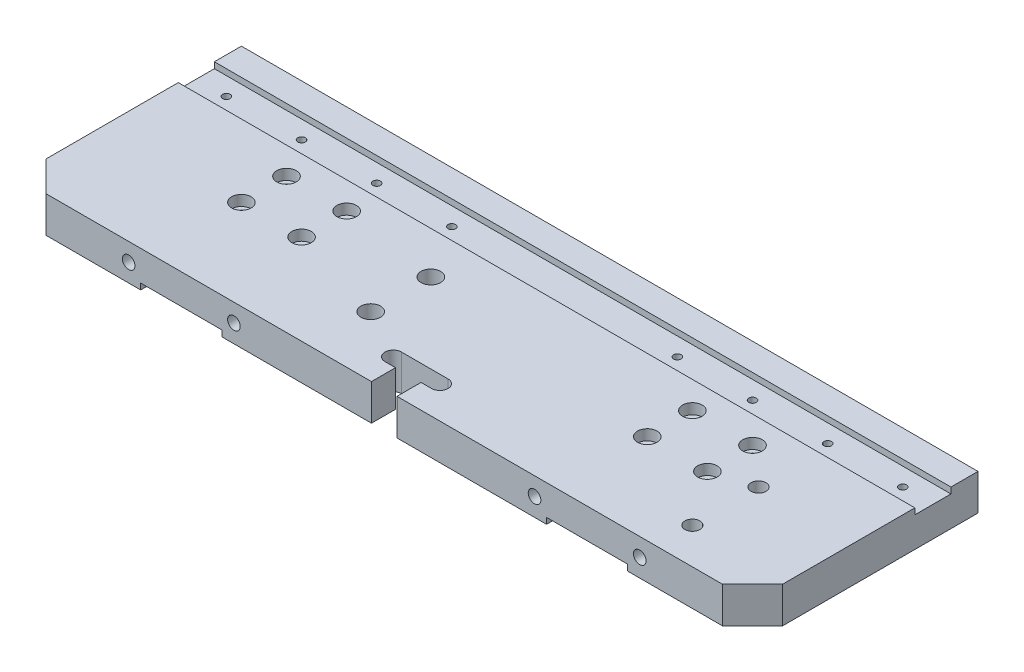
from build123d import *

# Parameters (mm, degrees)
EXTRUDE_1_DEPTH          = 75
SKETCH_2_R               = 2.1
CUT_EXTRUDE_1_DEPTH      = 15
CUT_EXTRUDE_2_DEPTH      = 257.503411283
CUT_EXTRUDE_2_DEPTH_BACK = 257.503411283
SKETCH_3_W               = 12
SKETCH_3_H               = 2
SKETCH_5_R               = 2.5
CUT_EXTRUDE_3_DEPTH      = 15
SKETCH_6_OUTSIDE_W       = 298.3
SKETCH_6_OUTSIDE_H       = 128.3
SKETCH_6_OUTSIDE_R       = 1.25
SKETCH_6_OUTSIDE_R_2     = 2.5
SKETCH_6_OUTSIDE_R_3     = 1.75
SKETCH_6_OUTSIDE_R_4     = 3.25
CUT_EXTRUDE_4_DEPTH      = 15
SKETCH_7_R               = 3.25
CUT_EXTRUDE_5_DEPTH      = 3.5
SKETCH_9_R               = 5.5
CUT_EXTRUDE_6_DEPTH      = 3.5


with BuildPart() as part:
    # Sketch 1 → Extrude 1 (new body)
    with BuildSketch(Plane.XY):
        Polygon((0, 12), (245, 12), (245, 0), (203.5, 0), (203.5, 2), (176.5, 2), (176.5, 0), (68.5, 0), (68.5, 2), (41.5, 2), (41.5, 0), (0, 0), align=None)
    extrude(amount=EXTRUDE_1_DEPTH)

    # Sketch 2 → Cut-Extrude 1 (cut)
    with BuildSketch(Plane.XY.offset(75)):
        with Locations((37.5, 6)):
            Circle(SKETCH_2_R)
        with Locations((72.5, 6)):
            Circle(SKETCH_2_R)
        with Locations((172.5, 6)):
            Circle(SKETCH_2_R)
        with Locations((207.5, 6)):
            Circle(SKETCH_2_R)
    extrude(amount=-CUT_EXTRUDE_1_DEPTH, mode=Mode.SUBTRACT)

    # Sketch 3 → Cut-Extrude 2 (cut, two sides: drawn at the far end of the back side and taken through both)
    with BuildSketch(Plane(origin=(245, 0, 0), x_dir=(0, 0, -1), z_dir=(1, 0, 0)).offset(-CUT_EXTRUDE_2_DEPTH_BACK)):
        with Locations((-15, 11)):
            Rectangle(SKETCH_3_W, SKETCH_3_H)
    extrude(amount=CUT_EXTRUDE_2_DEPTH + CUT_EXTRUDE_2_DEPTH_BACK, mode=Mode.SUBTRACT)

    # Sketch 5 → Cut-Extrude 3 (cut)
    with BuildSketch(Plane.ZY):
        with Locations((38, 6)):
            Circle(SKETCH_5_R)
        with Locations((52, 6)):
            Circle(SKETCH_5_R)
    extrude(amount=-CUT_EXTRUDE_3_DEPTH, mode=Mode.SUBTRACT)

    # Sketch 6 outside → Cut-Extrude 4 (cut)
    # profile 1 of 21: a face of its own
    with BuildSketch(Plane(origin=(0, 12, 0), x_dir=(1, 0, 0), z_dir=(0, 1, 0))):
        with Locations((122.5, -37.5)):
            Rectangle(SKETCH_6_OUTSIDE_W, SKETCH_6_OUTSIDE_H)
        with BuildLine():
            Line((0, -65), (0, 0))
            Line((0, 0), (245, 0))
            Line((245, 0), (245, -65))
            Line((245, -65), (235, -75))
            Line((235, -75), (126.75, -75))
            Line((126.75, -75), (126.75, -67))
            Line((126.75, -67), (130.25, -67))
            ThreePointArc((130.25, -67), (133, -64.25), (130.25, -61.5))
            Line((130.25, -61.5), (114.75, -61.5))
            ThreePointArc((114.75, -61.5), (112, -64.25), (114.75, -67))
            Line((114.75, -67), (118.25, -67))
            Line((118.25, -67), (118.25, -75))
            Line((118.25, -75), (10, -75))
            Line((10, -75), (0, -65))
        make_face(mode=Mode.SUBTRACT)
    # profile 2 of 21: a face of its own
    with BuildSketch(Plane(origin=(0, 12, 0), x_dir=(1, 0, 0), z_dir=(0, 1, 0))):
        with Locations(Location((10, -15, 0), (0, 0, 270))):
            Circle(SKETCH_6_OUTSIDE_R)
    # profile 3 of 21: a face of its own
    with BuildSketch(Plane(origin=(0, 12, 0), x_dir=(1, 0, 0), z_dir=(0, 1, 0))):
        with Locations(Location((35, -15, 0), (0, 0, 270))):
            Circle(SKETCH_6_OUTSIDE_R)
    # profile 4 of 21: a face of its own
    with BuildSketch(Plane(origin=(0, 12, 0), x_dir=(1, 0, 0), z_dir=(0, 1, 0))):
        with Locations(Location((60, -15, 0), (0, 0, 270))):
            Circle(SKETCH_6_OUTSIDE_R)
    # profile 5 of 21: a face of its own
    with BuildSketch(Plane(origin=(0, 12, 0), x_dir=(1, 0, 0), z_dir=(0, 1, 0))):
        with Locations(Location((85, -15, 0), (0, 0, 270))):
            Circle(SKETCH_6_OUTSIDE_R)
    # profile 6 of 21: a face of its own
    with BuildSketch(Plane(origin=(0, 12, 0), x_dir=(1, 0, 0), z_dir=(0, 1, 0))):
        with Locations(Location((160, -15, 0), (0, 0, 270))):
            Circle(SKETCH_6_OUTSIDE_R)
    # profile 7 of 21: a face of its own
    with BuildSketch(Plane(origin=(0, 12, 0), x_dir=(1, 0, 0), z_dir=(0, 1, 0))):
        with Locations(Location((185, -15, 0), (0, 0, 270))):
            Circle(SKETCH_6_OUTSIDE_R)
    # profile 8 of 21: a face of its own
    with BuildSketch(Plane(origin=(0, 12, 0), x_dir=(1, 0, 0), z_dir=(0, 1, 0))):
        with Locations(Location((210, -15, 0), (0, 0, 270))):
            Circle(SKETCH_6_OUTSIDE_R)
    # profile 9 of 21: a face of its own
    with BuildSketch(Plane(origin=(0, 12, 0), x_dir=(1, 0, 0), z_dir=(0, 1, 0))):
        with Locations(Location((235, -15, 0), (0, 0, 270))):
            Circle(SKETCH_6_OUTSIDE_R)
    # profile 10 of 21: a face of its own
    with BuildSketch(Plane(origin=(0, 12, 0), x_dir=(1, 0, 0), z_dir=(0, 1, 0))):
        with Locations(Location((213, -41, 0), (0, 0, 270))):
            Circle(SKETCH_6_OUTSIDE_R_2)
    # profile 11 of 21: a face of its own
    with BuildSketch(Plane(origin=(0, 12, 0), x_dir=(1, 0, 0), z_dir=(0, 1, 0))):
        with Locations(Location((213, -63, 0), (0, 0, 270))):
            Circle(SKETCH_6_OUTSIDE_R_2)
    # profile 12 of 21: a face of its own
    with BuildSketch(Plane(origin=(0, 12, 0), x_dir=(1, 0, 0), z_dir=(0, 1, 0))):
        with Locations(Location((45, -30, 0), (0, 0, 270))):
            Circle(SKETCH_6_OUTSIDE_R_3)
    # profile 13 of 21: a face of its own
    with BuildSketch(Plane(origin=(0, 12, 0), x_dir=(1, 0, 0), z_dir=(0, 1, 0))):
        with Locations(Location((65, -30, 0), (0, 0, 270))):
            Circle(SKETCH_6_OUTSIDE_R_3)
    # profile 14 of 21: a face of its own
    with BuildSketch(Plane(origin=(0, 12, 0), x_dir=(1, 0, 0), z_dir=(0, 1, 0))):
        with Locations(Location((65, -45, 0), (0, 0, 270))):
            Circle(SKETCH_6_OUTSIDE_R_3)
    # profile 15 of 21: a face of its own
    with BuildSketch(Plane(origin=(0, 12, 0), x_dir=(1, 0, 0), z_dir=(0, 1, 0))):
        with Locations(Location((45, -45, 0), (0, 0, 270))):
            Circle(SKETCH_6_OUTSIDE_R_3)
    # profile 16 of 21: a face of its own
    with BuildSketch(Plane(origin=(0, 12, 0), x_dir=(1, 0, 0), z_dir=(0, 1, 0))):
        with Locations(Location((180, -30, 0), (0, 0, 270))):
            Circle(SKETCH_6_OUTSIDE_R_3)
    # profile 17 of 21: a face of its own
    with BuildSketch(Plane(origin=(0, 12, 0), x_dir=(1, 0, 0), z_dir=(0, 1, 0))):
        with Locations(Location((200, -30, 0), (0, 0, 270))):
            Circle(SKETCH_6_OUTSIDE_R_3)
    # profile 18 of 21: a face of its own
    with BuildSketch(Plane(origin=(0, 12, 0), x_dir=(1, 0, 0), z_dir=(0, 1, 0))):
        with Locations(Location((200, -45, 0), (0, 0, 270))):
            Circle(SKETCH_6_OUTSIDE_R_3)
    # profile 19 of 21: a face of its own
    with BuildSketch(Plane(origin=(0, 12, 0), x_dir=(1, 0, 0), z_dir=(0, 1, 0))):
        with Locations(Location((180, -45, 0), (0, 0, 270))):
            Circle(SKETCH_6_OUTSIDE_R_3)
    # profile 20 of 21: a face of its own
    with BuildSketch(Plane(origin=(0, 12, 0), x_dir=(1, 0, 0), z_dir=(0, 1, 0))):
        with Locations(Location((98, -55, 0), (0, 0, 270))):
            Circle(SKETCH_6_OUTSIDE_R_4)
    # profile 21 of 21: a face of its own
    with BuildSketch(Plane(origin=(0, 12, 0), x_dir=(1, 0, 0), z_dir=(0, 1, 0))):
        with Locations(Location((98, -35, 0), (0, 0, 270))):
            Circle(SKETCH_6_OUTSIDE_R_4)
    extrude(amount=-CUT_EXTRUDE_4_DEPTH, mode=Mode.SUBTRACT)

    # Sketch 7 → Cut-Extrude 5 (cut)
    with BuildSketch(Plane(origin=(0, 12, 0), x_dir=(1, 0, 0), z_dir=(0, 1, 0))):
        with Locations(Location((45, -30, 0), (0, 0, 270))):
            Circle(SKETCH_7_R)
        with Locations(Location((65, -30, 0), (0, 0, 270))):
            Circle(SKETCH_7_R)
        with Locations(Location((65, -45, 0), (0, 0, 270))):
            Circle(SKETCH_7_R)
        with Locations(Location((45, -45, 0), (0, 0, 270))):
            Circle(SKETCH_7_R)
        with Locations(Location((180, -30, 0), (0, 0, 270))):
            Circle(SKETCH_7_R)
        with Locations(Location((200, -30, 0), (0, 0, 270))):
            Circle(SKETCH_7_R)
        with Locations(Location((200, -45, 0), (0, 0, 270))):
            Circle(SKETCH_7_R)
        with Locations(Location((180, -45, 0), (0, 0, 270))):
            Circle(SKETCH_7_R)
    extrude(amount=-CUT_EXTRUDE_5_DEPTH, mode=Mode.SUBTRACT)

    # Sketch 9 → Cut-Extrude 6 (cut)
    with BuildSketch(Plane.XZ):
        with Locations(Location((98, 55, 0), (0, 0, 270))):
            Circle(SKETCH_9_R)
        with Locations(Location((98, 35, 0), (0, 0, 270))):
            Circle(SKETCH_9_R)
    extrude(amount=-CUT_EXTRUDE_6_DEPTH, mode=Mode.SUBTRACT)


solid = part.part
